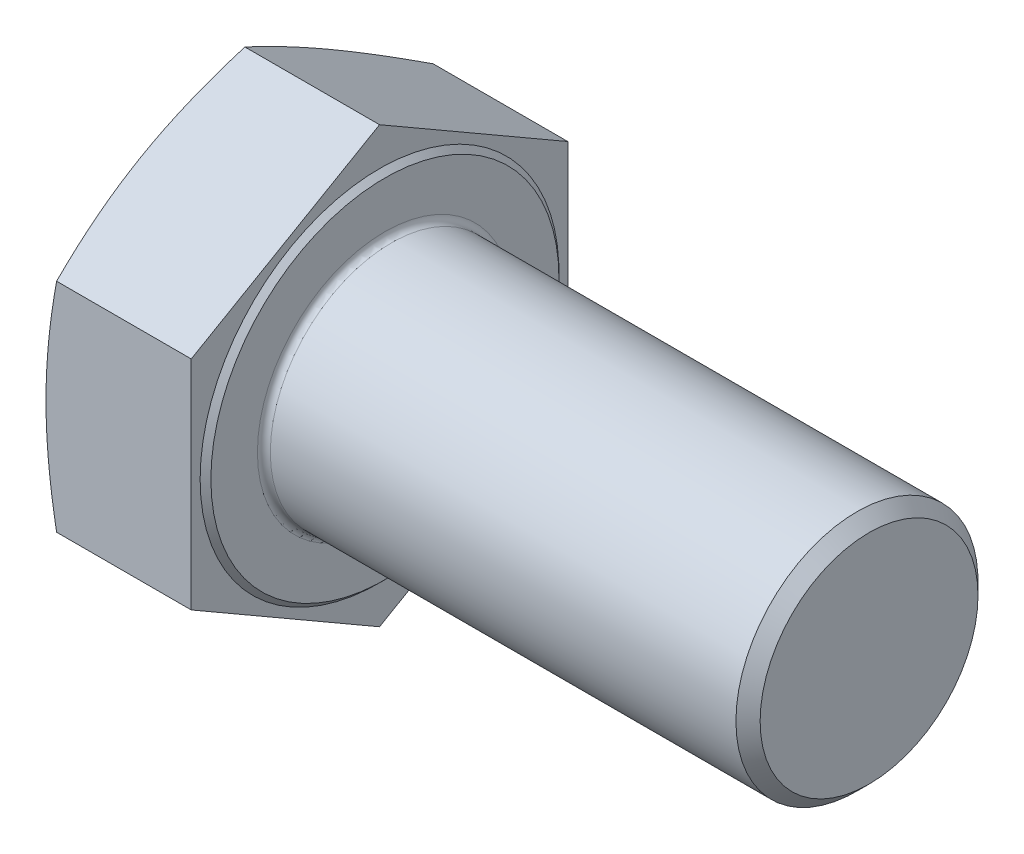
from build123d import *

# Parameters (mm, degrees)
BASEHEAD_DEPTH = 28
SKETCH5_R      = 22.5
BASEBODY_DEPTH = 90
CHAMFER1_SIZE  = 2.25
HEADFILLET_R   = 1.2


with BuildPart() as part:
    # Sketch2 → BaseHead (new body)
    with BuildSketch(Plane(origin=(0, 0, 0), x_dir=(0, 0, -1), z_dir=(1, 0, 0))):
        Polygon((0, -40.414518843), (35, -20.207259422), (35, 20.207259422), (0, 40.414518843), (-35, 20.207259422), (-35, -20.207259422), align=None)
    extrude(amount=BASEHEAD_DEPTH)

    # Sketch3 → BearingFace (revolve, cut)
    with BuildSketch(Plane.XY, mode=Mode.PRIVATE) as bearingface_sk:
        Polygon((28, 40.414518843), (28, 32.35), (27, 33.35), (27, 40.414518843), align=None)
    revolve(bearingface_sk.sketch.rotate(Axis((-0.957090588, 0, 0), (1, 0, 0)), 90), axis=Axis((-0.957090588, 0, 0), (1, 0, 0)), mode=Mode.SUBTRACT)

    # Sketch4 → HeadChamfer (revolve, cut)
    with BuildSketch(Plane.XY):
        Polygon((0, 40.414518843), (1.970723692, 40.414518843), (0, 35), align=None)
    revolve(axis=Axis((-0.493528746, 0, 0), (1, 0, 0)), mode=Mode.SUBTRACT)

    # Sketch5 → BaseBody (add)
    with BuildSketch(Plane(origin=(28, 0, 0), x_dir=(0, 0, -1), z_dir=(1, 0, 0))):
        with Locations(Location((0, 0, 0), (0, 0, 180))):
            Circle(SKETCH5_R)
    extrude(amount=BASEBODY_DEPTH)

    # Chamfer1
    chamfer1_edges = [part.edges().sort_by_distance(p)[0] for p in [
        (118, 0, -22.5),
    ]]
    chamfer(chamfer1_edges, length=CHAMFER1_SIZE)

    # HeadFillet
    headfillet_edges = [part.edges().sort_by_distance(p)[0] for p in [
        (28, 0, -22.5),
    ]]
    fillet(headfillet_edges, radius=HEADFILLET_R)


solid = part.part
